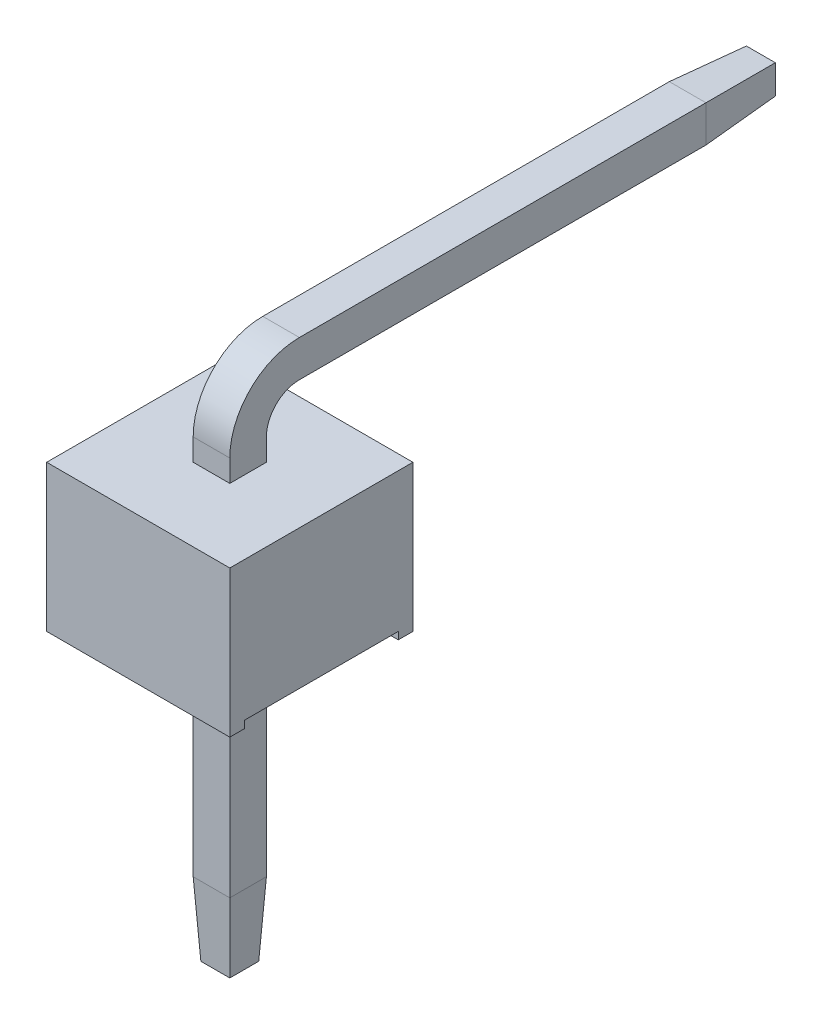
from build123d import *

# Parameters (mm, degrees)
CROQUIS1_W              = 2.5
CROQUIS1_H              = 2.5
SALIENTE_EXTRUIR1_DEPTH = 2
CROQUIS2_W              = 2.5
CROQUIS2_H              = 2.1
CORTAR_EXTRUIR1_DEPTH   = 0.1
CROQUIS3_W              = 0.5
CROQUIS3_H              = 0.5
SALIENTE_EXTRUIR2_DEPTH = 4
CROQUIS5_OUTSIDE_W      = 5.98
CROQUIS5_OUTSIDE_H      = 5.98
CROQUIS5_OUTSIDE_W_2    = 0.5
CROQUIS5_OUTSIDE_H_2    = 0.5
CORTAR_EXTRUIR2_DEPTH   = 1
CORTAR_EXTRUIR2_DRAFT   = -3
CROQUIS6_W              = 0.5
CROQUIS6_H              = 0.5
CROQUIS8_OUTSIDE_W      = 6.882
CROQUIS8_OUTSIDE_H      = 11.532
CROQUIS8_OUTSIDE_W_2    = 0.5
CROQUIS8_OUTSIDE_H_2    = 0.5
CORTAR_EXTRUIR3_DEPTH   = 1
CORTAR_EXTRUIR3_DRAFT   = -3


with BuildPart() as part:
    # Croquis1 → Saliente-Extruir1 (new body)
    with BuildSketch(Plane(origin=(0, 0, 0), x_dir=(1, 0, 0), z_dir=(0, 1, 0))):
        Rectangle(CROQUIS1_W, CROQUIS1_H)
    extrude(amount=SALIENTE_EXTRUIR1_DEPTH)

    # Croquis2 → Cortar-Extruir1 (cut)
    with BuildSketch(Plane.XZ):
        Rectangle(CROQUIS2_W, CROQUIS2_H)
    extrude(amount=-CORTAR_EXTRUIR1_DEPTH, mode=Mode.SUBTRACT)

    # Croquis3 → Saliente-Extruir2 (add)
    with BuildSketch(Plane.XZ.offset(-0.1)):
        Rectangle(CROQUIS3_W, CROQUIS3_H)
    extrude(amount=SALIENTE_EXTRUIR2_DEPTH)


with BuildPart() as cortar_extruir2_tool:
    # Croquis5 outside → Cortar-Extruir2 (with draft: the straight prism first)
    with BuildSketch(Plane(origin=(0, -2.9, 0), x_dir=(-1, 0, 0), z_dir=(0, -1, 0))):
        Rectangle(CROQUIS5_OUTSIDE_W, CROQUIS5_OUTSIDE_H)
        Rectangle(CROQUIS5_OUTSIDE_W_2, CROQUIS5_OUTSIDE_H_2, mode=Mode.SUBTRACT)
    extrude(amount=CORTAR_EXTRUIR2_DEPTH)
    # Cortar-Extruir2: the draft: its side faces are tilted about the plane it starts from
    cortar_extruir2_sides = [cortar_extruir2_tool.faces().sort_by_distance(p)[0] for p in [
        (0, -3.4, 2.99),
        (-2.99, -3.4, 0),
        (0, -3.4, -2.99),
        (2.99, -3.4, 0),
        (0, -3.4, -0.25),
        (-0.25, -3.4, 0),
        (0, -3.4, 0.25),
        (0.25, -3.4, 0),
    ]]
    draft(cortar_extruir2_sides, Plane(origin=(0, -2.9, 0), x_dir=(-1, 0, 0), z_dir=(0, -1, 0)), CORTAR_EXTRUIR2_DRAFT)


with BuildPart() as part_1:
    add(part.part)

    # Cortar-Extruir2: cut by cortar_extruir2_tool
    add(cortar_extruir2_tool.part, mode=Mode.SUBTRACT)

    # Barrer1: sweep along a path in Croquis7
    with BuildLine(Plane(origin=(0, 0, 0), x_dir=(0, 0, -1), z_dir=(1, 0, 0))) as barrer1_path:
        Line((0, 2), (0, 2.3))
        ThreePointArc((0, 2.3), (0.205025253, 2.794974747), (0.7, 3))
        Line((0.7, 3), (7.25, 3))
    # Croquis6 → Barrer1 (sweep)
    with BuildSketch(Plane(origin=(0, 2, 0), x_dir=(1, 0, 0), z_dir=(0, 1, 0))):
        Rectangle(CROQUIS6_W, CROQUIS6_H)
    sweep(path=barrer1_path.line)


with BuildPart() as cortar_extruir3_tool:
    # Croquis8 outside → Cortar-Extruir3 (with draft: the straight prism first)
    with BuildSketch(Plane(origin=(0, 0, -6.25), x_dir=(-1, 0, 0), z_dir=(0, 0, -1))):
        with Locations((0, -0.325)):
            Rectangle(CROQUIS8_OUTSIDE_W, CROQUIS8_OUTSIDE_H)
        with Locations((0, 3)):
            Rectangle(CROQUIS8_OUTSIDE_W_2, CROQUIS8_OUTSIDE_H_2, mode=Mode.SUBTRACT)
    extrude(amount=CORTAR_EXTRUIR3_DEPTH)
    # Cortar-Extruir3: the draft: its side faces are tilted about the plane it starts from
    cortar_extruir3_sides = [cortar_extruir3_tool.faces().sort_by_distance(p)[0] for p in [
        (0, -6.091, -6.75),
        (-3.441, -0.325, -6.75),
        (0, 5.441, -6.75),
        (3.441, -0.325, -6.75),
        (0, 2.75, -6.75),
        (0.25, 3, -6.75),
        (0, 3.25, -6.75),
        (-0.25, 3, -6.75),
    ]]
    draft(cortar_extruir3_sides, Plane(origin=(0, 0, -6.25), x_dir=(-1, 0, 0), z_dir=(0, 0, -1)), CORTAR_EXTRUIR3_DRAFT)


with BuildPart() as part_2:
    add(part_1.part)

    # Cortar-Extruir3: cut by cortar_extruir3_tool
    add(cortar_extruir3_tool.part, mode=Mode.SUBTRACT)


solid = part_2.part
